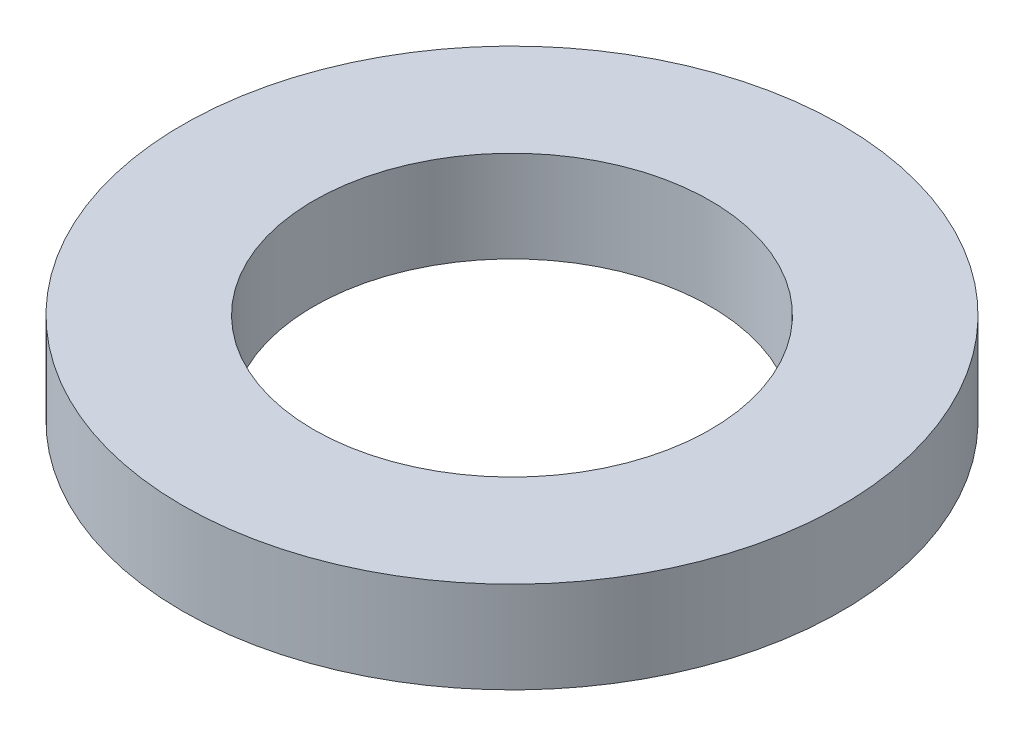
from build123d import *

# Parameters (mm, degrees)
SCHIZZO1_R                   = 5.4
SCHIZZO1_R_2                 = 3.25
ESTRUSIONE_ESTRUSIONE1_DEPTH = 1.5


with BuildPart() as part:
    # Schizzo1 → Estrusione-Estrusione1 (new body)
    with BuildSketch(Plane(origin=(0, 0, 0), x_dir=(1, 0, 0), z_dir=(0, 1, 0))):
        with Locations(Location((0, 0, 0), (0, 0, 270))):
            Circle(SCHIZZO1_R)
        with Locations(Location((0, 0, 0), (0, 0, 270))):
            Circle(SCHIZZO1_R_2, mode=Mode.SUBTRACT)
    extrude(amount=ESTRUSIONE_ESTRUSIONE1_DEPTH)


solid = part.part
